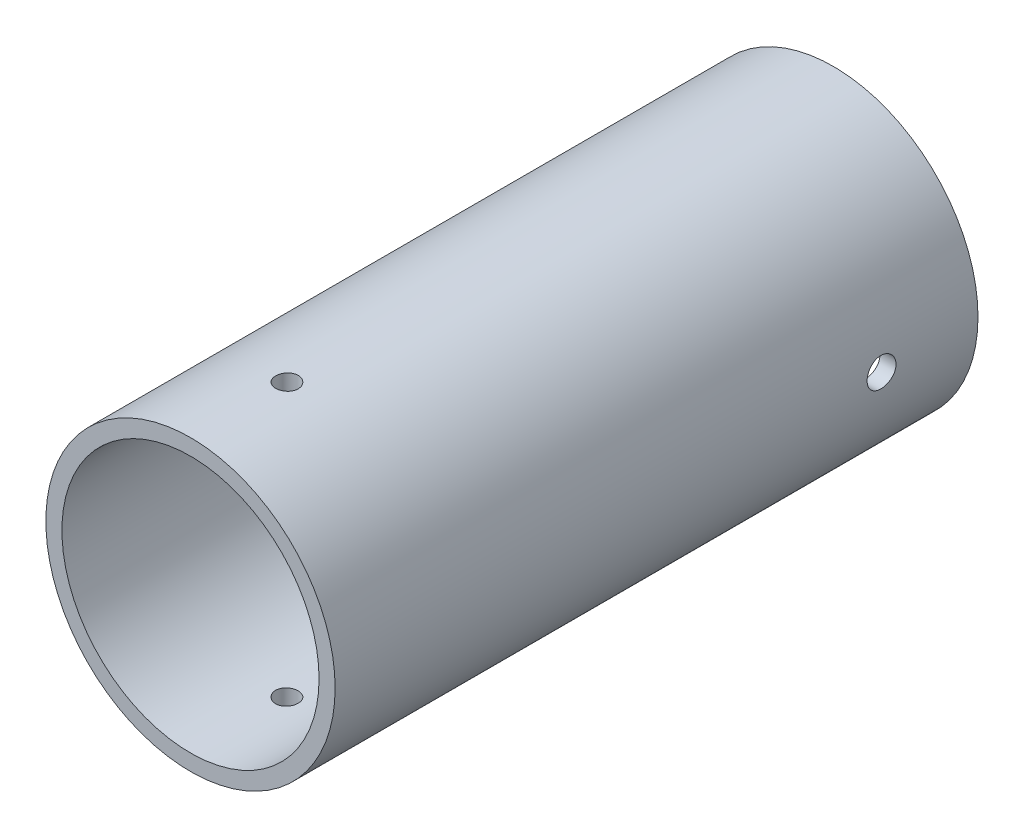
ISO-10303-21;
HEADER;
FILE_DESCRIPTION(('STEP AP214'),'2;1');
FILE_NAME('part.step','',(''),(''),'','','');
FILE_SCHEMA(('AUTOMOTIVE_DESIGN { 1 0 10303 214 1 1 1 1 }'));
ENDSEC;
DATA;
#1=APPLICATION_CONTEXT('core data for automotive mechanical design processes');
#2=APPLICATION_PROTOCOL_DEFINITION('international standard','automotive_design',2000,#1);
#3=PRODUCT_CONTEXT('',#1,'mechanical');
#4=PRODUCT('Part','Part','',(#3));
#5=PRODUCT_RELATED_PRODUCT_CATEGORY('part','',(#4));
#6=PRODUCT_DEFINITION_FORMATION('','',#4);
#7=PRODUCT_DEFINITION_CONTEXT('part definition',#1,'design');
#8=PRODUCT_DEFINITION('design','',#6,#7);
#9=PRODUCT_DEFINITION_SHAPE('','',#8);
#10=(LENGTH_UNIT() NAMED_UNIT(*) SI_UNIT(.MILLI.,.METRE.));
#11=(NAMED_UNIT(*) PLANE_ANGLE_UNIT() SI_UNIT($,.RADIAN.));
#12=(NAMED_UNIT(*) SI_UNIT($,.STERADIAN.) SOLID_ANGLE_UNIT());
#13=UNCERTAINTY_MEASURE_WITH_UNIT(LENGTH_MEASURE(1.E-05),#10,'distance_accuracy_value','');
#14=(GEOMETRIC_REPRESENTATION_CONTEXT(3) GLOBAL_UNCERTAINTY_ASSIGNED_CONTEXT((#13)) GLOBAL_UNIT_ASSIGNED_CONTEXT((#10,
#11,#12)) REPRESENTATION_CONTEXT('',''));
#15=CARTESIAN_POINT('',(0.,0.,0.));
#16=DIRECTION('',(0.,0.,1.));
#17=DIRECTION('',(1.,0.,0.));
#18=AXIS2_PLACEMENT_3D('',#15,#16,#17);
#19=CARTESIAN_POINT('',(0.,0.,-100.));
#20=DIRECTION('',(0.,0.,1.));
#21=DIRECTION('',(1.,0.,0.));
#22=AXIS2_PLACEMENT_3D('',#19,#20,#21);
#23=CYLINDRICAL_SURFACE('',#22,22.5);
#24=CARTESIAN_POINT('',(-22.5,0.,-52.5919987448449));
#25=CARTESIAN_POINT('',(-22.4999999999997,-5.61704679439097E-05,-52.5919987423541));
#26=CARTESIAN_POINT('',(-22.4999999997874,-0.000112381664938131,-52.5919939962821));
#27=CARTESIAN_POINT('',(-22.4999999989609,-0.000223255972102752,-52.5919751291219));
#28=CARTESIAN_POINT('',(-22.4999999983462,-0.000277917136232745,-52.5919609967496));
#29=CARTESIAN_POINT('',(-22.4999999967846,-0.000384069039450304,-52.5919237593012));
#30=CARTESIAN_POINT('',(-22.4999999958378,-0.000435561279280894,-52.591900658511));
#31=CARTESIAN_POINT('',(-22.4999999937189,-0.000533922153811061,-52.5918461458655));
#32=CARTESIAN_POINT('',(-22.4999999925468,-0.000580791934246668,-52.5918147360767));
#33=CARTESIAN_POINT('',(-22.499999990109,-0.00066859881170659,-52.5917444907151));
#34=CARTESIAN_POINT('',(-22.4999999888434,-0.00070953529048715,-52.5917056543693));
#35=CARTESIAN_POINT('',(-22.4999999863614,-0.000784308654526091,-52.5916216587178));
#36=CARTESIAN_POINT('',(-22.499999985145,-0.000818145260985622,-52.5915764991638));
#37=CARTESIAN_POINT('',(-22.4999999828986,-0.00087775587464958,-52.5914811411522));
#38=CARTESIAN_POINT('',(-22.4999999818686,-0.000903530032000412,-52.5914309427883));
#39=CARTESIAN_POINT('',(-22.4999999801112,-0.000946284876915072,-52.5913269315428));
#40=CARTESIAN_POINT('',(-22.4999999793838,-0.000963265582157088,-52.5912731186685));
#41=CARTESIAN_POINT('',(-22.4999999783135,-0.00098795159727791,-52.591163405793));
#42=CARTESIAN_POINT('',(-22.4999999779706,-0.000995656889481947,-52.5911075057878));
#43=CARTESIAN_POINT('',(-22.499999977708,-0.00100157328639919,-52.5909952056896));
#44=CARTESIAN_POINT('',(-22.4999999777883,-0.000999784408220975,-52.5909388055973));
#45=CARTESIAN_POINT('',(-22.4999999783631,-0.00098676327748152,-52.5908271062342));
#46=CARTESIAN_POINT('',(-22.4999999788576,-0.000975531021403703,-52.5907718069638));
#47=CARTESIAN_POINT('',(-22.4999999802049,-0.000943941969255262,-52.5906638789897));
#48=CARTESIAN_POINT('',(-22.4999999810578,-0.000923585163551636,-52.5906112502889));
#49=CARTESIAN_POINT('',(-22.4999999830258,-0.000874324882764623,-52.5905101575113));
#50=CARTESIAN_POINT('',(-22.4999999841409,-0.000845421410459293,-52.5904616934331));
#51=CARTESIAN_POINT('',(-22.4999999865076,-0.00077988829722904,-52.5903703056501));
#52=CARTESIAN_POINT('',(-22.4999999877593,-0.000743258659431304,-52.5903273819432));
#53=CARTESIAN_POINT('',(-22.499999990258,-0.000663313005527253,-52.5902482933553));
#54=CARTESIAN_POINT('',(-22.4999999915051,-0.000619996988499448,-52.5902121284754));
#55=CARTESIAN_POINT('',(-22.499999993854,-0.000527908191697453,-52.5901475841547));
#56=CARTESIAN_POINT('',(-22.4999999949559,-0.000479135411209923,-52.590119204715));
#57=CARTESIAN_POINT('',(-22.4999999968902,-0.000377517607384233,-52.5900710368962));
#58=CARTESIAN_POINT('',(-22.4999999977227,-0.000324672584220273,-52.5900512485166));
#59=CARTESIAN_POINT('',(-22.4999999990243,-0.000216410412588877,-52.5900208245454));
#60=CARTESIAN_POINT('',(-22.4999999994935,-0.000160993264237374,-52.5900101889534));
#61=CARTESIAN_POINT('',(-22.5000000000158,-4.91599688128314E-05,-52.5899983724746));
#62=CARTESIAN_POINT('',(-22.5000000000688,7.2561782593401E-06,-52.5899971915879));
#63=CARTESIAN_POINT('',(-22.4999999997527,0.000119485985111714,-52.5900043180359));
#64=CARTESIAN_POINT('',(-22.4999999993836,0.000175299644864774,-52.5900126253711));
#65=CARTESIAN_POINT('',(-22.4999999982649,0.000284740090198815,-52.5900384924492));
#66=CARTESIAN_POINT('',(-22.4999999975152,0.000338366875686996,-52.5900560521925));
#67=CARTESIAN_POINT('',(-22.4999999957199,0.000441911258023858,-52.5900999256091));
#68=CARTESIAN_POINT('',(-22.4999999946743,0.000491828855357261,-52.5901262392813));
#69=CARTESIAN_POINT('',(-22.4999999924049,0.000586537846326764,-52.5901868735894));
#70=CARTESIAN_POINT('',(-22.4999999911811,0.000631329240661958,-52.5902211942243));
#71=CARTESIAN_POINT('',(-22.4999999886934,0.000714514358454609,-52.5902968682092));
#72=CARTESIAN_POINT('',(-22.4999999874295,0.000752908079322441,-52.590338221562));
#73=CARTESIAN_POINT('',(-22.499999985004,0.00082220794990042,-52.5904267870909));
#74=CARTESIAN_POINT('',(-22.4999999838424,0.000853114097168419,-52.5904739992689));
#75=CARTESIAN_POINT('',(-22.4999999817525,0.000906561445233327,-52.5905729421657));
#76=CARTESIAN_POINT('',(-22.4999999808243,0.000929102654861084,-52.5906246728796));
#77=CARTESIAN_POINT('',(-22.4999999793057,0.000965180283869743,-52.590731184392));
#78=CARTESIAN_POINT('',(-22.4999999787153,0.000978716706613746,-52.5907859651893));
#79=CARTESIAN_POINT('',(-22.4999999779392,0.000996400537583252,-52.5908970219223));
#80=CARTESIAN_POINT('',(-22.4999999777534,0.00100054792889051,-52.5909532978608));
#81=CARTESIAN_POINT('',(-22.4999999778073,0.000999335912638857,-52.5910657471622));
#82=CARTESIAN_POINT('',(-22.499999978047,0.000993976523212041,-52.5911219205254));
#83=CARTESIAN_POINT('',(-22.4999999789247,0.000973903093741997,-52.5912325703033));
#84=CARTESIAN_POINT('',(-22.4999999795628,0.000959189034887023,-52.5912870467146));
#85=CARTESIAN_POINT('',(-22.4999999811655,0.0009208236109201,-52.5913927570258));
#86=CARTESIAN_POINT('',(-22.4999999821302,0.000897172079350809,-52.5914439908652));
#87=CARTESIAN_POINT('',(-22.4999999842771,0.000841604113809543,-52.591541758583));
#88=CARTESIAN_POINT('',(-22.4999999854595,0.000809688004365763,-52.5915882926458));
#89=CARTESIAN_POINT('',(-22.4999999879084,0.000738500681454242,-52.5916753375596));
#90=CARTESIAN_POINT('',(-22.4999999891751,0.000699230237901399,-52.5917158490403));
#91=CARTESIAN_POINT('',(-22.4999999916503,0.000614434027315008,-52.5917897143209));
#92=CARTESIAN_POINT('',(-22.4999999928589,0.000568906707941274,-52.5918230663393));
#93=CARTESIAN_POINT('',(-22.499999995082,0.000472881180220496,-52.5918816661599));
#94=CARTESIAN_POINT('',(-22.4999999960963,0.000422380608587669,-52.5919069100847));
#95=CARTESIAN_POINT('',(-22.4999999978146,0.00031789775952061,-52.5919485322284));
#96=CARTESIAN_POINT('',(-22.4999999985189,0.000263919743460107,-52.5919649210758));
#97=CARTESIAN_POINT('',(-22.4999999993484,0.000174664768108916,-52.5919839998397));
#98=CARTESIAN_POINT('',(-22.4999999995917,0.000139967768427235,-52.5919895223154));
#99=CARTESIAN_POINT('',(-22.4999999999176,7.01858140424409E-05,-52.5919968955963));
#100=CARTESIAN_POINT('',(-22.5000000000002,3.5100859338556E-05,-52.5919987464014));
#101=CARTESIAN_POINT('',(-22.5,0.,-52.5919987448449));
#102=B_SPLINE_CURVE_WITH_KNOTS('',3,(#24,#25,#26,#27,#28,#29,#30,#31,#32,#33,#34,#35,#36,#37,
#38,#39,#40,#41,#42,#43,#44,#45,#46,#47,#48,#49,#50,#51,#52,#53,#54,#55,#56,#57,#58,#59,#60,#61,
#62,#63,#64,#65,#66,#67,#68,#69,#70,#71,#72,#73,#74,#75,#76,#77,#78,#79,#80,#81,#82,#83,#84,#85,
#86,#87,#88,#89,#90,#91,#92,#93,#94,#95,#96,#97,#98,#99,#100,#101),.UNSPECIFIED.,.T.,.F.,(4,2,2,
2,2,2,2,2,2,2,2,2,2,2,2,2,2,2,2,2,2,2,2,2,2,2,2,2,2,2,2,2,2,2,2,2,2,2,4),(0.,
0.00016838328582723,0.000336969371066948,0.000505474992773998,0.000673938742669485,
0.000842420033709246,0.00101090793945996,0.00117939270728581,0.00134787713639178,
0.00151636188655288,0.00168484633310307,0.00185333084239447,0.00202181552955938,
0.00219030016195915,0.00235878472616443,0.0025272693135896,0.00269575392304,0.00286423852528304,
0.00303272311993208,0.00320120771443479,0.00336969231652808,0.00353817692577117,
0.00370666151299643,0.00387514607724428,0.00404363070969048,0.00421211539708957,
0.00438059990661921,0.00454908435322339,0.00471756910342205,0.00488605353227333,
0.00505453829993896,0.00522302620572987,0.00539150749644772,0.00555997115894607,
0.0057284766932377,0.00589706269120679,0.00606544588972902,0.00617066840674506,
0.00627589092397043),.UNSPECIFIED.);
#103=CARTESIAN_POINT('',(-22.5,0.,-52.5919987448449));
#104=VERTEX_POINT('',#103);
#105=EDGE_CURVE('E176',#104,#104,#102,.T.);
#106=ORIENTED_EDGE('',*,*,#105,.F.);
#107=EDGE_LOOP('',(#106));
#108=FACE_BOUND('',#107,.T.);
#109=CARTESIAN_POINT('',(0.,-22.5,-13.25));
#110=CARTESIAN_POINT('',(-0.0981391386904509,-22.4999991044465,-13.2500042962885));
#111=CARTESIAN_POINT('',(-0.196345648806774,-22.4993510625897,-13.2582831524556));
#112=CARTESIAN_POINT('',(-0.390043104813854,-22.4968282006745,-13.2911881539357));
#113=CARTESIAN_POINT('',(-0.485530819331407,-22.4949519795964,-13.3158329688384));
#114=CARTESIAN_POINT('',(-0.670957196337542,-22.4901848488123,-13.3807543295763));
#115=CARTESIAN_POINT('',(-0.760898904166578,-22.487294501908,-13.4210222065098));
#116=CARTESIAN_POINT('',(-0.932724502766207,-22.4808235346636,-13.5160315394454));
#117=CARTESIAN_POINT('',(-1.01461014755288,-22.477243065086,-13.5707698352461));
#118=CARTESIAN_POINT('',(-1.16820468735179,-22.4697848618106,-13.6932989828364));
#119=CARTESIAN_POINT('',(-1.23989307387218,-22.4659065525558,-13.76111550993));
#120=CARTESIAN_POINT('',(-1.37088229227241,-22.4582946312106,-13.9078220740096));
#121=CARTESIAN_POINT('',(-1.43018258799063,-22.4545610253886,-13.9867125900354));
#122=CARTESIAN_POINT('',(-1.53478037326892,-22.4476548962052,-14.1534501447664));
#123=CARTESIAN_POINT('',(-1.58006005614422,-22.4444830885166,-14.241308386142));
#124=CARTESIAN_POINT('',(-1.65521751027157,-22.4390660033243,-14.4234092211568));
#125=CARTESIAN_POINT('',(-1.68509552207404,-22.4368207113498,-14.5176517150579));
#126=CARTESIAN_POINT('',(-1.72854257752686,-22.4335155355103,-14.7096420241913));
#127=CARTESIAN_POINT('',(-1.74214476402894,-22.4324532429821,-14.8073822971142));
#128=CARTESIAN_POINT('',(-1.75275641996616,-22.4316266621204,-15.0037640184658));
#129=CARTESIAN_POINT('',(-1.74976616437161,-22.4318623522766,-15.1024054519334));
#130=CARTESIAN_POINT('',(-1.72730523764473,-22.4336029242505,-15.2975626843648));
#131=CARTESIAN_POINT('',(-1.70787053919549,-22.4351050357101,-15.394082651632));
#132=CARTESIAN_POINT('',(-1.65312826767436,-22.4392048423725,-15.5824863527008));
#133=CARTESIAN_POINT('',(-1.61782055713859,-22.4418025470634,-15.6743700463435));
#134=CARTESIAN_POINT('',(-1.5322940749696,-22.4478040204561,-15.8510078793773));
#135=CARTESIAN_POINT('',(-1.48205911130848,-22.4512086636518,-15.9357541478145));
#136=CARTESIAN_POINT('',(-1.36811579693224,-22.4584395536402,-16.0956254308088));
#137=CARTESIAN_POINT('',(-1.30440720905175,-22.4622658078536,-16.1707502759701));
#138=CARTESIAN_POINT('',(-1.16512309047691,-22.4699210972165,-16.3094553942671));
#139=CARTESIAN_POINT('',(-1.08951645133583,-22.4737501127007,-16.3730044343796));
#140=CARTESIAN_POINT('',(-0.928691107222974,-22.4809697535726,-16.4865127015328));
#141=CARTESIAN_POINT('',(-0.843472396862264,-22.4843603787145,-16.5364719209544));
#142=CARTESIAN_POINT('',(-0.665822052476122,-22.4903217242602,-16.6213802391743));
#143=CARTESIAN_POINT('',(-0.573389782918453,-22.4928923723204,-16.6563280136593));
#144=CARTESIAN_POINT('',(-0.38394519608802,-22.4969232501,-16.7101998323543));
#145=CARTESIAN_POINT('',(-0.286932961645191,-22.4983834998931,-16.7291241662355));
#146=CARTESIAN_POINT('',(-0.0913530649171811,-22.5000264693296,-16.7503728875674));
#147=CARTESIAN_POINT('',(0.00720988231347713,-22.5002125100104,-16.7527404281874));
#148=CARTESIAN_POINT('',(0.203331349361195,-22.499294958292,-16.7409213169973));
#149=CARTESIAN_POINT('',(0.300889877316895,-22.4981913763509,-16.7267347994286));
#150=CARTESIAN_POINT('',(0.492110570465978,-22.4948208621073,-16.6822460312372));
#151=CARTESIAN_POINT('',(0.585777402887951,-22.4925553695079,-16.6519637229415));
#152=CARTESIAN_POINT('',(0.76670026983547,-22.4871156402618,-16.5761633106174));
#153=CARTESIAN_POINT('',(0.853956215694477,-22.4839413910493,-16.530644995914));
#154=CARTESIAN_POINT('',(1.01977718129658,-22.4770319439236,-16.4255558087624));
#155=CARTESIAN_POINT('',(1.09832399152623,-22.4732956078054,-16.3659562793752));
#156=CARTESIAN_POINT('',(1.24431336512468,-22.4656858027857,-16.234437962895));
#157=CARTESIAN_POINT('',(1.31175576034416,-22.4618123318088,-16.1625189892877));
#158=CARTESIAN_POINT('',(1.43376934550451,-22.4543550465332,-16.0082163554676));
#159=CARTESIAN_POINT('',(1.48831242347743,-22.4507718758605,-15.9258104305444));
#160=CARTESIAN_POINT('',(1.58278648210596,-22.444309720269,-15.7529842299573));
#161=CARTESIAN_POINT('',(1.62271759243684,-22.4414307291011,-15.6625640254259));
#162=CARTESIAN_POINT('',(1.68678609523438,-22.4367063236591,-15.4763764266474));
#163=CARTESIAN_POINT('',(1.71094083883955,-22.4348597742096,-15.3806150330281));
#164=CARTESIAN_POINT('',(1.74282748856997,-22.4324054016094,-15.1863808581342));
#165=CARTESIAN_POINT('',(1.75055966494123,-22.4317975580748,-15.0879081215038));
#166=CARTESIAN_POINT('',(1.74937874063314,-22.431889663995,-14.8913259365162));
#167=CARTESIAN_POINT('',(1.74050981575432,-22.4325861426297,-14.7932162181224));
#168=CARTESIAN_POINT('',(1.70647040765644,-22.4352010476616,-14.5998840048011));
#169=CARTESIAN_POINT('',(1.68129989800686,-22.43711947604,-14.5046615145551));
#170=CARTESIAN_POINT('',(1.61538268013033,-22.4419612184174,-14.3198028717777));
#171=CARTESIAN_POINT('',(1.57463660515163,-22.4448844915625,-14.2301664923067));
#172=CARTESIAN_POINT('',(1.47873005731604,-22.4514065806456,-14.0589997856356));
#173=CARTESIAN_POINT('',(1.42356985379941,-22.4550053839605,-13.9774693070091));
#174=CARTESIAN_POINT('',(1.30023520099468,-22.4624843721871,-13.8246030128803));
#175=CARTESIAN_POINT('',(1.23202818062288,-22.4663652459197,-13.7532935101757));
#176=CARTESIAN_POINT('',(1.08459226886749,-22.4739648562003,-13.6231078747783));
#177=CARTESIAN_POINT('',(1.00536070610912,-22.4776835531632,-13.5642347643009));
#178=CARTESIAN_POINT('',(0.837990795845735,-22.4845456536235,-13.4605248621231));
#179=CARTESIAN_POINT('',(0.749837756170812,-22.4876880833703,-13.4157117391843));
#180=CARTESIAN_POINT('',(0.567295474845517,-22.4930317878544,-13.3415795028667));
#181=CARTESIAN_POINT('',(0.47291358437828,-22.4952341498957,-13.3122424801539));
#182=CARTESIAN_POINT('',(0.31497390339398,-22.4978807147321,-13.2774121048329));
#183=CARTESIAN_POINT('',(0.252433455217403,-22.4986718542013,-13.2671461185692));
#184=CARTESIAN_POINT('',(0.126604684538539,-22.4997317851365,-13.2534386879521));
#185=CARTESIAN_POINT('',(0.0633163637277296,-22.5000005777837,-13.2499972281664));
#186=CARTESIAN_POINT('',(0.,-22.5,-13.25));
#187=B_SPLINE_CURVE_WITH_KNOTS('',3,(#109,#110,#111,#112,#113,#114,#115,#116,#117,#118,#119,
#120,#121,#122,#123,#124,#125,#126,#127,#128,#129,#130,#131,#132,#133,#134,#135,#136,#137,#138,
#139,#140,#141,#142,#143,#144,#145,#146,#147,#148,#149,#150,#151,#152,#153,#154,#155,#156,#157,
#158,#159,#160,#161,#162,#163,#164,#165,#166,#167,#168,#169,#170,#171,#172,#173,#174,#175,#176,
#177,#178,#179,#180,#181,#182,#183,#184,#185,#186),.UNSPECIFIED.,.T.,.F.,(4,2,2,2,2,2,2,2,2,2,2,
2,2,2,2,2,2,2,2,2,2,2,2,2,2,2,2,2,2,2,2,2,2,2,2,2,2,2,4),(0.,0.294186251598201,
0.588708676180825,0.883067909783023,1.17736291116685,1.47224166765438,1.76713318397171,
2.06239770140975,2.35765760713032,2.65231523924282,2.94696798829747,3.24097783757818,
3.53499023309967,3.82932272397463,4.12366039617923,4.41878083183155,4.71390143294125,
5.00904806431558,5.30418935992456,5.59856111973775,5.89293049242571,6.18693599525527,
6.48094556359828,6.77555871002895,7.07017631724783,7.3654301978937,7.66068145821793,
7.95560744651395,8.25052858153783,8.54466604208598,8.83880397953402,9.13292995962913,
9.42705044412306,9.72191500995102,10.0168511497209,10.3122811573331,10.6073685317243,
10.7971689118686,10.9869688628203),.UNSPECIFIED.);
#188=CARTESIAN_POINT('',(0.,-22.5,-13.25));
#189=VERTEX_POINT('',#188);
#190=EDGE_CURVE('E56',#189,#189,#187,.T.);
#191=ORIENTED_EDGE('',*,*,#190,.F.);
#192=EDGE_LOOP('',(#191));
#193=FACE_BOUND('',#192,.T.);
#194=CARTESIAN_POINT('',(0.,22.5,-13.25));
#195=CARTESIAN_POINT('',(0.0981391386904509,22.4999991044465,-13.2500042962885));
#196=CARTESIAN_POINT('',(0.196345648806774,22.4993510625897,-13.2582831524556));
#197=CARTESIAN_POINT('',(0.390043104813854,22.4968282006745,-13.2911881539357));
#198=CARTESIAN_POINT('',(0.485530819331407,22.4949519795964,-13.3158329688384));
#199=CARTESIAN_POINT('',(0.670957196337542,22.4901848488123,-13.3807543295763));
#200=CARTESIAN_POINT('',(0.760898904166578,22.487294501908,-13.4210222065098));
#201=CARTESIAN_POINT('',(0.932724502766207,22.4808235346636,-13.5160315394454));
#202=CARTESIAN_POINT('',(1.01461014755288,22.477243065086,-13.5707698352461));
#203=CARTESIAN_POINT('',(1.16820468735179,22.4697848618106,-13.6932989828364));
#204=CARTESIAN_POINT('',(1.23989307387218,22.4659065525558,-13.76111550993));
#205=CARTESIAN_POINT('',(1.37088229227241,22.4582946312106,-13.9078220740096));
#206=CARTESIAN_POINT('',(1.43018258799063,22.4545610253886,-13.9867125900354));
#207=CARTESIAN_POINT('',(1.53478037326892,22.4476548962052,-14.1534501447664));
#208=CARTESIAN_POINT('',(1.58006005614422,22.4444830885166,-14.241308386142));
#209=CARTESIAN_POINT('',(1.65521751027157,22.4390660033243,-14.4234092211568));
#210=CARTESIAN_POINT('',(1.68509552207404,22.4368207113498,-14.5176517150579));
#211=CARTESIAN_POINT('',(1.72854257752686,22.4335155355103,-14.7096420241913));
#212=CARTESIAN_POINT('',(1.74214476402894,22.4324532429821,-14.8073822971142));
#213=CARTESIAN_POINT('',(1.75275641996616,22.4316266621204,-15.0037640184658));
#214=CARTESIAN_POINT('',(1.74976616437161,22.4318623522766,-15.1024054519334));
#215=CARTESIAN_POINT('',(1.72730523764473,22.4336029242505,-15.2975626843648));
#216=CARTESIAN_POINT('',(1.70787053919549,22.4351050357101,-15.394082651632));
#217=CARTESIAN_POINT('',(1.65312826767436,22.4392048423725,-15.5824863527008));
#218=CARTESIAN_POINT('',(1.61782055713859,22.4418025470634,-15.6743700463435));
#219=CARTESIAN_POINT('',(1.5322940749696,22.4478040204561,-15.8510078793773));
#220=CARTESIAN_POINT('',(1.48205911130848,22.4512086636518,-15.9357541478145));
#221=CARTESIAN_POINT('',(1.36811579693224,22.4584395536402,-16.0956254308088));
#222=CARTESIAN_POINT('',(1.30440720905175,22.4622658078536,-16.1707502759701));
#223=CARTESIAN_POINT('',(1.16512309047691,22.4699210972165,-16.3094553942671));
#224=CARTESIAN_POINT('',(1.08951645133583,22.4737501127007,-16.3730044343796));
#225=CARTESIAN_POINT('',(0.928691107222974,22.4809697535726,-16.4865127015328));
#226=CARTESIAN_POINT('',(0.843472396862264,22.4843603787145,-16.5364719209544));
#227=CARTESIAN_POINT('',(0.665822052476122,22.4903217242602,-16.6213802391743));
#228=CARTESIAN_POINT('',(0.573389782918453,22.4928923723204,-16.6563280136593));
#229=CARTESIAN_POINT('',(0.38394519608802,22.4969232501,-16.7101998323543));
#230=CARTESIAN_POINT('',(0.286932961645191,22.4983834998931,-16.7291241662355));
#231=CARTESIAN_POINT('',(0.0913530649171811,22.5000264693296,-16.7503728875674));
#232=CARTESIAN_POINT('',(-0.00720988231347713,22.5002125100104,-16.7527404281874));
#233=CARTESIAN_POINT('',(-0.203331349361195,22.499294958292,-16.7409213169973));
#234=CARTESIAN_POINT('',(-0.300889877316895,22.4981913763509,-16.7267347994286));
#235=CARTESIAN_POINT('',(-0.492110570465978,22.4948208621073,-16.6822460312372));
#236=CARTESIAN_POINT('',(-0.585777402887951,22.4925553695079,-16.6519637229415));
#237=CARTESIAN_POINT('',(-0.76670026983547,22.4871156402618,-16.5761633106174));
#238=CARTESIAN_POINT('',(-0.853956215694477,22.4839413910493,-16.530644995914));
#239=CARTESIAN_POINT('',(-1.01977718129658,22.4770319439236,-16.4255558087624));
#240=CARTESIAN_POINT('',(-1.09832399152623,22.4732956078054,-16.3659562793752));
#241=CARTESIAN_POINT('',(-1.24431336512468,22.4656858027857,-16.234437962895));
#242=CARTESIAN_POINT('',(-1.31175576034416,22.4618123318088,-16.1625189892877));
#243=CARTESIAN_POINT('',(-1.43376934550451,22.4543550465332,-16.0082163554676));
#244=CARTESIAN_POINT('',(-1.48831242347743,22.4507718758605,-15.9258104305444));
#245=CARTESIAN_POINT('',(-1.58278648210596,22.444309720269,-15.7529842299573));
#246=CARTESIAN_POINT('',(-1.62271759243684,22.4414307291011,-15.6625640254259));
#247=CARTESIAN_POINT('',(-1.68678609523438,22.4367063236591,-15.4763764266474));
#248=CARTESIAN_POINT('',(-1.71094083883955,22.4348597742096,-15.3806150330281));
#249=CARTESIAN_POINT('',(-1.74282748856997,22.4324054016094,-15.1863808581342));
#250=CARTESIAN_POINT('',(-1.75055966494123,22.4317975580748,-15.0879081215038));
#251=CARTESIAN_POINT('',(-1.74937874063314,22.431889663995,-14.8913259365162));
#252=CARTESIAN_POINT('',(-1.74050981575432,22.4325861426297,-14.7932162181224));
#253=CARTESIAN_POINT('',(-1.70647040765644,22.4352010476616,-14.5998840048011));
#254=CARTESIAN_POINT('',(-1.68129989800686,22.43711947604,-14.5046615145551));
#255=CARTESIAN_POINT('',(-1.61538268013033,22.4419612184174,-14.3198028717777));
#256=CARTESIAN_POINT('',(-1.57463660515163,22.4448844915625,-14.2301664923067));
#257=CARTESIAN_POINT('',(-1.47873005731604,22.4514065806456,-14.0589997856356));
#258=CARTESIAN_POINT('',(-1.42356985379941,22.4550053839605,-13.9774693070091));
#259=CARTESIAN_POINT('',(-1.30023520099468,22.4624843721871,-13.8246030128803));
#260=CARTESIAN_POINT('',(-1.23202818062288,22.4663652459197,-13.7532935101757));
#261=CARTESIAN_POINT('',(-1.08459226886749,22.4739648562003,-13.6231078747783));
#262=CARTESIAN_POINT('',(-1.00536070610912,22.4776835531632,-13.5642347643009));
#263=CARTESIAN_POINT('',(-0.837990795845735,22.4845456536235,-13.4605248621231));
#264=CARTESIAN_POINT('',(-0.749837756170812,22.4876880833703,-13.4157117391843));
#265=CARTESIAN_POINT('',(-0.567295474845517,22.4930317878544,-13.3415795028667));
#266=CARTESIAN_POINT('',(-0.47291358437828,22.4952341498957,-13.3122424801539));
#267=CARTESIAN_POINT('',(-0.31497390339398,22.4978807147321,-13.2774121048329));
#268=CARTESIAN_POINT('',(-0.252433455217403,22.4986718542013,-13.2671461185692));
#269=CARTESIAN_POINT('',(-0.126604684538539,22.4997317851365,-13.2534386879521));
#270=CARTESIAN_POINT('',(-0.0633163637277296,22.5000005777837,-13.2499972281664));
#271=CARTESIAN_POINT('',(0.,22.5,-13.25));
#272=B_SPLINE_CURVE_WITH_KNOTS('',3,(#194,#195,#196,#197,#198,#199,#200,#201,#202,#203,#204,
#205,#206,#207,#208,#209,#210,#211,#212,#213,#214,#215,#216,#217,#218,#219,#220,#221,#222,#223,
#224,#225,#226,#227,#228,#229,#230,#231,#232,#233,#234,#235,#236,#237,#238,#239,#240,#241,#242,
#243,#244,#245,#246,#247,#248,#249,#250,#251,#252,#253,#254,#255,#256,#257,#258,#259,#260,#261,
#262,#263,#264,#265,#266,#267,#268,#269,#270,#271),.UNSPECIFIED.,.T.,.F.,(4,2,2,2,2,2,2,2,2,2,2,
2,2,2,2,2,2,2,2,2,2,2,2,2,2,2,2,2,2,2,2,2,2,2,2,2,2,2,4),(0.,0.294186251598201,
0.588708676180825,0.883067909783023,1.17736291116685,1.47224166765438,1.76713318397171,
2.06239770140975,2.35765760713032,2.65231523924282,2.94696798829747,3.24097783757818,
3.53499023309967,3.82932272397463,4.12366039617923,4.41878083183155,4.71390143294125,
5.00904806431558,5.30418935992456,5.59856111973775,5.89293049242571,6.18693599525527,
6.48094556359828,6.77555871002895,7.07017631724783,7.3654301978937,7.66068145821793,
7.95560744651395,8.25052858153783,8.54466604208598,8.83880397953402,9.13292995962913,
9.42705044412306,9.72191500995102,10.0168511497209,10.3122811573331,10.6073685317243,
10.7971689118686,10.9869688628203),.UNSPECIFIED.);
#273=CARTESIAN_POINT('',(0.,22.5,-13.25));
#274=VERTEX_POINT('',#273);
#275=EDGE_CURVE('E179',#274,#274,#272,.T.);
#276=ORIENTED_EDGE('',*,*,#275,.F.);
#277=EDGE_LOOP('',(#276));
#278=FACE_BOUND('',#277,.T.);
#279=CARTESIAN_POINT('',(0.,0.,0.));
#280=DIRECTION('',(0.,0.,1.));
#281=DIRECTION('',(1.,0.,0.));
#282=AXIS2_PLACEMENT_3D('',#279,#280,#281);
#283=CIRCLE('',#282,22.5);
#284=CARTESIAN_POINT('',(22.5,0.,0.));
#285=VERTEX_POINT('',#284);
#286=EDGE_CURVE('E40',#285,#285,#283,.T.);
#287=ORIENTED_EDGE('',*,*,#286,.F.);
#288=EDGE_LOOP('',(#287));
#289=FACE_BOUND('',#288,.T.);
#290=CARTESIAN_POINT('',(0.,0.,-100.));
#291=DIRECTION('',(0.,0.,1.));
#292=DIRECTION('',(1.,0.,0.));
#293=AXIS2_PLACEMENT_3D('',#290,#291,#292);
#294=CIRCLE('',#293,22.5);
#295=CARTESIAN_POINT('',(22.5,0.,-100.));
#296=VERTEX_POINT('',#295);
#297=EDGE_CURVE('E10',#296,#296,#294,.T.);
#298=ORIENTED_EDGE('',*,*,#297,.T.);
#299=EDGE_LOOP('',(#298));
#300=FACE_BOUND('',#299,.T.);
#301=CARTESIAN_POINT('',(22.5,0.,-87.25));
#302=CARTESIAN_POINT('',(22.4999985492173,-0.126045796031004,-87.2499945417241));
#303=CARTESIAN_POINT('',(22.4989295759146,-0.252174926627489,-87.239372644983));
#304=CARTESIAN_POINT('',(22.4947680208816,-0.500936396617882,-87.1971601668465));
#305=CARTESIAN_POINT('',(22.4916732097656,-0.623564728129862,-87.1655464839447));
#306=CARTESIAN_POINT('',(22.4838093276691,-0.861686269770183,-87.0822799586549));
#307=CARTESIAN_POINT('',(22.4790412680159,-0.977183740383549,-87.0306392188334));
#308=CARTESIAN_POINT('',(22.4683640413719,-1.19784636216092,-86.9088079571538));
#309=CARTESIAN_POINT('',(22.462455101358,-1.30301356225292,-86.8386211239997));
#310=CARTESIAN_POINT('',(22.4501342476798,-1.50043398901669,-86.6814189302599));
#311=CARTESIAN_POINT('',(22.443720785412,-1.59264482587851,-86.5943504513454));
#312=CARTESIAN_POINT('',(22.4311265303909,-1.76117067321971,-86.4059697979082));
#313=CARTESIAN_POINT('',(22.4249457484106,-1.83748494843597,-86.3046569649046));
#314=CARTESIAN_POINT('',(22.4135008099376,-1.97220143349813,-86.0903983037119));
#315=CARTESIAN_POINT('',(22.4082386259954,-2.03056529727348,-85.9774282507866));
#316=CARTESIAN_POINT('',(22.3992458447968,-2.12747936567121,-85.7432299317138));
#317=CARTESIAN_POINT('',(22.3955152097,-2.1660300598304,-85.6220018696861));
#318=CARTESIAN_POINT('',(22.390021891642,-2.22209784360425,-85.3751609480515));
#319=CARTESIAN_POINT('',(22.3882526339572,-2.23968521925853,-85.2495642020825));
#320=CARTESIAN_POINT('',(22.3868619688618,-2.25354439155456,-84.9971900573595));
#321=CARTESIAN_POINT('',(22.3872405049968,-2.2498167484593,-84.8704126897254));
#322=CARTESIAN_POINT('',(22.390096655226,-2.22120963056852,-84.61976055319));
#323=CARTESIAN_POINT('',(22.3925666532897,-2.19640689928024,-84.4958769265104));
#324=CARTESIAN_POINT('',(22.3993155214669,-2.12647307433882,-84.2540395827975));
#325=CARTESIAN_POINT('',(22.4035944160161,-2.08134170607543,-84.1360859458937));
#326=CARTESIAN_POINT('',(22.4134877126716,-1.97194701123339,-83.9092144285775));
#327=CARTESIAN_POINT('',(22.4191044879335,-1.90764963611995,-83.8003130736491));
#328=CARTESIAN_POINT('',(22.4310386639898,-1.76177256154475,-83.5948182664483));
#329=CARTESIAN_POINT('',(22.4373560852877,-1.68019235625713,-83.498225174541));
#330=CARTESIAN_POINT('',(22.4500136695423,-1.50163675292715,-83.3196428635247));
#331=CARTESIAN_POINT('',(22.4563538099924,-1.40459507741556,-83.2377198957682));
#332=CARTESIAN_POINT('',(22.4683161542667,-1.19810133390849,-83.0913168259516));
#333=CARTESIAN_POINT('',(22.4739383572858,-1.0886492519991,-83.0268367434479));
#334=CARTESIAN_POINT('',(22.4838332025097,-0.860395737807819,-82.9171524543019));
#335=CARTESIAN_POINT('',(22.4881056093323,-0.741592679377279,-82.8719516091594));
#336=CARTESIAN_POINT('',(22.4948170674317,-0.498031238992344,-82.8021574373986));
#337=CARTESIAN_POINT('',(22.4972561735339,-0.373273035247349,-82.7775634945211));
#338=CARTESIAN_POINT('',(22.500019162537,-0.121916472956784,-82.7497653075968));
#339=CARTESIAN_POINT('',(22.5003520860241,0.0046716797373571,-82.7464696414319));
#340=CARTESIAN_POINT('',(22.4988894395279,0.256598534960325,-82.7611214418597));
#341=CARTESIAN_POINT('',(22.4970938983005,0.381937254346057,-82.7790686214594));
#342=CARTESIAN_POINT('',(22.4915818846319,0.627543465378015,-82.8356208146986));
#343=CARTESIAN_POINT('',(22.4878693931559,0.747820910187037,-82.8741830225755));
#344=CARTESIAN_POINT('',(22.4789399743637,0.980199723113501,-82.9708266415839));
#345=CARTESIAN_POINT('',(22.4737230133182,1.09230090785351,-83.0289084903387));
#346=CARTESIAN_POINT('',(22.4623456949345,1.30555840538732,-83.1631693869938));
#347=CARTESIAN_POINT('',(22.4561822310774,1.40667673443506,-83.2394085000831));
#348=CARTESIAN_POINT('',(22.4436134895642,1.59471365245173,-83.4077336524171));
#349=CARTESIAN_POINT('',(22.4372082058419,1.68163188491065,-83.4998200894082));
#350=CARTESIAN_POINT('',(22.424850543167,1.83911874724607,-83.6976247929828));
#351=CARTESIAN_POINT('',(22.4188998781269,1.90962737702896,-83.8033909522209));
#352=CARTESIAN_POINT('',(22.40815123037,2.0318810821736,-84.02531656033));
#353=CARTESIAN_POINT('',(22.4033532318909,2.08362641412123,-84.1414758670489));
#354=CARTESIAN_POINT('',(22.3954638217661,2.16678421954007,-84.380684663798));
#355=CARTESIAN_POINT('',(22.3923694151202,2.19823239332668,-84.503721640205));
#356=CARTESIAN_POINT('',(22.3882282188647,2.24001901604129,-84.7533621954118));
#357=CARTESIAN_POINT('',(22.3871813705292,2.25035807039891,-84.8799656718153));
#358=CARTESIAN_POINT('',(22.3872550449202,2.24962456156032,-85.1325490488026));
#359=CARTESIAN_POINT('',(22.3883660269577,2.2386462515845,-85.2585292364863));
#360=CARTESIAN_POINT('',(22.3926098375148,2.19578726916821,-85.5068460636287));
#361=CARTESIAN_POINT('',(22.3957426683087,2.16390657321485,-85.6291826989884));
#362=CARTESIAN_POINT('',(22.4036745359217,2.08017379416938,-85.8667390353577));
#363=CARTESIAN_POINT('',(22.4084733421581,2.02832447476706,-85.9819597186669));
#364=CARTESIAN_POINT('',(22.4191969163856,1.90613599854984,-86.2020780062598));
#365=CARTESIAN_POINT('',(22.4251216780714,1.83579694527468,-86.3069756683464));
#366=CARTESIAN_POINT('',(22.4374609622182,1.67827175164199,-86.5039532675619));
#367=CARTESIAN_POINT('',(22.4438774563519,1.5910153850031,-86.595976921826));
#368=CARTESIAN_POINT('',(22.4564592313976,1.40227132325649,-86.7641175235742));
#369=CARTESIAN_POINT('',(22.462624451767,1.30078022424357,-86.8402306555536));
#370=CARTESIAN_POINT('',(22.4740251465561,1.08616822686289,-86.9745402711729));
#371=CARTESIAN_POINT('',(22.4792582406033,0.973018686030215,-87.0326911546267));
#372=CARTESIAN_POINT('',(22.4881791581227,0.738581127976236,-87.1290904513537));
#373=CARTESIAN_POINT('',(22.4918687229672,0.617302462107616,-87.1673613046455));
#374=CARTESIAN_POINT('',(22.496359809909,0.412781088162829,-87.2133713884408));
#375=CARTESIAN_POINT('',(22.4977185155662,0.33084574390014,-87.2270883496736));
#376=CARTESIAN_POINT('',(22.4995390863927,0.165952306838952,-87.245404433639));
#377=CARTESIAN_POINT('',(22.5000009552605,0.0829942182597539,-87.2500035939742));
#378=CARTESIAN_POINT('',(22.5,0.,-87.25));
#379=B_SPLINE_CURVE_WITH_KNOTS('',3,(#301,#302,#303,#304,#305,#306,#307,#308,#309,#310,#311,
#312,#313,#314,#315,#316,#317,#318,#319,#320,#321,#322,#323,#324,#325,#326,#327,#328,#329,#330,
#331,#332,#333,#334,#335,#336,#337,#338,#339,#340,#341,#342,#343,#344,#345,#346,#347,#348,#349,
#350,#351,#352,#353,#354,#355,#356,#357,#358,#359,#360,#361,#362,#363,#364,#365,#366,#367,#368,
#369,#370,#371,#372,#373,#374,#375,#376,#377,#378),.UNSPECIFIED.,.T.,.F.,(4,2,2,2,2,2,2,2,2,2,2,
2,2,2,2,2,2,2,2,2,2,2,2,2,2,2,2,2,2,2,2,2,2,2,2,2,2,2,4),(0.,0.377834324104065,
0.756085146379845,1.13410774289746,1.51205520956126,1.89121177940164,2.27038588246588,
2.65036444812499,3.03033362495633,3.40902522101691,3.78770686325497,4.16501544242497,
4.54232911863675,4.92031713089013,5.29831620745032,5.67798151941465,6.05764725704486,
6.43737916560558,6.81709971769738,7.19518924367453,7.57327366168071,7.95057604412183,
8.32788688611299,8.7064636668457,9.08504995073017,9.46499948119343,9.8449438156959,
10.2242180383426,10.6034813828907,10.981071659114,11.3586623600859,11.736200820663,
12.1137371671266,12.4928756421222,12.8721049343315,13.2522891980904,13.6320433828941,
13.8808275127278,14.1296106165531),.UNSPECIFIED.);
#380=CARTESIAN_POINT('',(22.5,0.,-87.25));
#381=VERTEX_POINT('',#380);
#382=EDGE_CURVE('E55',#381,#381,#379,.T.);
#383=ORIENTED_EDGE('',*,*,#382,.T.);
#384=EDGE_LOOP('',(#383));
#385=FACE_BOUND('',#384,.T.);
#386=ADVANCED_FACE('F28',(#108,#193,#278,#289,#300,#385),#23,.T.);
#387=CARTESIAN_POINT('',(0.,0.,-100.));
#388=DIRECTION('',(0.,0.,1.));
#389=DIRECTION('',(1.,0.,0.));
#390=AXIS2_PLACEMENT_3D('',#387,#388,#389);
#391=CYLINDRICAL_SURFACE('',#390,20.);
#392=CARTESIAN_POINT('',(-20.,0.,-52.5919987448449));
#393=CARTESIAN_POINT('',(-19.9999999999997,-5.61704679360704E-05,-52.5919987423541));
#394=CARTESIAN_POINT('',(-19.9999999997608,-0.000112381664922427,-52.5919939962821));
#395=CARTESIAN_POINT('',(-19.999999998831,-0.000223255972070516,-52.5919751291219));
#396=CARTESIAN_POINT('',(-19.9999999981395,-0.000277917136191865,-52.5919609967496));
#397=CARTESIAN_POINT('',(-19.9999999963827,-0.000384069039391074,-52.5919237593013));
#398=CARTESIAN_POINT('',(-19.9999999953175,-0.000435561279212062,-52.5919006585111));
#399=CARTESIAN_POINT('',(-19.9999999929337,-0.000533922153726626,-52.5918461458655));
#400=CARTESIAN_POINT('',(-19.9999999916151,-0.000580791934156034,-52.5918147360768));
#401=CARTESIAN_POINT('',(-19.9999999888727,-0.000668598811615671,-52.5917444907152));
#402=CARTESIAN_POINT('',(-19.9999999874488,-0.000709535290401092,-52.5917056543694));
#403=CARTESIAN_POINT('',(-19.9999999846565,-0.000784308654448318,-52.5916216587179));
#404=CARTESIAN_POINT('',(-19.9999999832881,-0.000818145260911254,-52.5915764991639));
#405=CARTESIAN_POINT('',(-19.9999999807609,-0.000877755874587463,-52.5914811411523));
#406=CARTESIAN_POINT('',(-19.9999999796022,-0.000903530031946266,-52.5914309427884));
#407=CARTESIAN_POINT('',(-19.9999999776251,-0.000946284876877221,-52.5913269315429));
#408=CARTESIAN_POINT('',(-19.9999999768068,-0.000963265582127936,-52.5912731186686));
#409=CARTESIAN_POINT('',(-19.9999999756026,-0.000987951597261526,-52.591163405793));
#410=CARTESIAN_POINT('',(-19.9999999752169,-0.000995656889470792,-52.5911075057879));
#411=CARTESIAN_POINT('',(-19.9999999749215,-0.00100157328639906,-52.5909952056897));
#412=CARTESIAN_POINT('',(-19.9999999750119,-0.000999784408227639,-52.5909388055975));
#413=CARTESIAN_POINT('',(-19.9999999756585,-0.000986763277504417,-52.5908271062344));
#414=CARTESIAN_POINT('',(-19.9999999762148,-0.000975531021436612,-52.5907718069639));
#415=CARTESIAN_POINT('',(-19.9999999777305,-0.000943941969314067,-52.5906638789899));
#416=CARTESIAN_POINT('',(-19.99999997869,-0.000923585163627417,-52.5906112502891));
#417=CARTESIAN_POINT('',(-19.999999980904,-0.000874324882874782,-52.5905101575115));
#418=CARTESIAN_POINT('',(-19.9999999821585,-0.000845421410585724,-52.5904616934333));
#419=CARTESIAN_POINT('',(-19.9999999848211,-0.000779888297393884,-52.5903703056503));
#420=CARTESIAN_POINT('',(-19.9999999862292,-0.000743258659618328,-52.5903273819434));
#421=CARTESIAN_POINT('',(-19.9999999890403,-0.000663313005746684,-52.5902482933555));
#422=CARTESIAN_POINT('',(-19.9999999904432,-0.000619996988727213,-52.5902121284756));
#423=CARTESIAN_POINT('',(-19.9999999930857,-0.000527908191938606,-52.5901475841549));
#424=CARTESIAN_POINT('',(-19.9999999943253,-0.000479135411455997,-52.5901192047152));
#425=CARTESIAN_POINT('',(-19.9999999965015,-0.000377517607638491,-52.5900710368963));
#426=CARTESIAN_POINT('',(-19.999999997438,-0.000324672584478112,-52.5900512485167));
#427=CARTESIAN_POINT('',(-19.9999999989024,-0.000216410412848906,-52.5900208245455));
#428=CARTESIAN_POINT('',(-19.9999999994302,-0.000160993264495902,-52.5900101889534));
#429=CARTESIAN_POINT('',(-20.0000000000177,-4.91599690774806E-05,-52.5899983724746));
#430=CARTESIAN_POINT('',(-20.0000000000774,7.25617798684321E-06,-52.5899971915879));
#431=CARTESIAN_POINT('',(-19.9999999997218,0.000119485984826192,-52.5900043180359));
#432=CARTESIAN_POINT('',(-19.9999999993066,0.000175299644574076,-52.5900126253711));
#433=CARTESIAN_POINT('',(-19.999999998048,0.000284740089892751,-52.5900384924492));
#434=CARTESIAN_POINT('',(-19.9999999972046,0.000338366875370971,-52.5900560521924));
#435=CARTESIAN_POINT('',(-19.9999999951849,0.000441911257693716,-52.590099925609));
#436=CARTESIAN_POINT('',(-19.9999999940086,0.000491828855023,-52.5901262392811));
#437=CARTESIAN_POINT('',(-19.9999999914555,0.000586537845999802,-52.5901868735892));
#438=CARTESIAN_POINT('',(-19.9999999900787,0.000631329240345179,-52.5902211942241));
#439=CARTESIAN_POINT('',(-19.9999999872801,0.000714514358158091,-52.5902968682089));
#440=CARTESIAN_POINT('',(-19.9999999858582,0.000752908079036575,-52.5903382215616));
#441=CARTESIAN_POINT('',(-19.9999999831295,0.000822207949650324,-52.5904267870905));
#442=CARTESIAN_POINT('',(-19.9999999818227,0.000853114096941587,-52.5904739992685));
#443=CARTESIAN_POINT('',(-19.9999999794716,0.000906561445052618,-52.5905729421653));
#444=CARTESIAN_POINT('',(-19.9999999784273,0.000929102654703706,-52.5906246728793));
#445=CARTESIAN_POINT('',(-19.9999999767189,0.000965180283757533,-52.5907311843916));
#446=CARTESIAN_POINT('',(-19.9999999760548,0.000978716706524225,-52.5907859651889));
#447=CARTESIAN_POINT('',(-19.9999999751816,0.000996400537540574,-52.5908970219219));
#448=CARTESIAN_POINT('',(-19.9999999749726,0.0010005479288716,-52.5909532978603));
#449=CARTESIAN_POINT('',(-19.9999999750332,0.000999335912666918,-52.5910657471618));
#450=CARTESIAN_POINT('',(-19.9999999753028,0.000993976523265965,-52.591121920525));
#451=CARTESIAN_POINT('',(-19.9999999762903,0.000973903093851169,-52.5912325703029));
#452=CARTESIAN_POINT('',(-19.9999999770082,0.000959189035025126,-52.5912870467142));
#453=CARTESIAN_POINT('',(-19.9999999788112,0.000920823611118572,-52.5913927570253));
#454=CARTESIAN_POINT('',(-19.9999999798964,0.000897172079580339,-52.5914439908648));
#455=CARTESIAN_POINT('',(-19.9999999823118,0.000841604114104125,-52.5915417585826));
#456=CARTESIAN_POINT('',(-19.9999999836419,0.000809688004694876,-52.5915882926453));
#457=CARTESIAN_POINT('',(-19.999999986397,0.000738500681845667,-52.5916753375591));
#458=CARTESIAN_POINT('',(-19.999999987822,0.000699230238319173,-52.5917158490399));
#459=CARTESIAN_POINT('',(-19.9999999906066,0.000614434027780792,-52.5917897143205));
#460=CARTESIAN_POINT('',(-19.9999999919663,0.00056890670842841,-52.5918230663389));
#461=CARTESIAN_POINT('',(-19.9999999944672,0.000472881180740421,-52.5918816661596));
#462=CARTESIAN_POINT('',(-19.9999999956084,0.000422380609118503,-52.5919069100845));
#463=CARTESIAN_POINT('',(-19.9999999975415,0.000317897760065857,-52.5919485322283));
#464=CARTESIAN_POINT('',(-19.9999999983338,0.000263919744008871,-52.5919649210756));
#465=CARTESIAN_POINT('',(-19.9999999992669,0.000174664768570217,-52.5919839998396));
#466=CARTESIAN_POINT('',(-19.9999999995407,0.000139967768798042,-52.5919895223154));
#467=CARTESIAN_POINT('',(-19.9999999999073,7.01858142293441E-05,-52.5919968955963));
#468=CARTESIAN_POINT('',(-20.0000000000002,3.51008594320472E-05,-52.5919987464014));
#469=CARTESIAN_POINT('',(-20.,0.,-52.5919987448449));
#470=B_SPLINE_CURVE_WITH_KNOTS('',3,(#392,#393,#394,#395,#396,#397,#398,#399,#400,#401,#402,
#403,#404,#405,#406,#407,#408,#409,#410,#411,#412,#413,#414,#415,#416,#417,#418,#419,#420,#421,
#422,#423,#424,#425,#426,#427,#428,#429,#430,#431,#432,#433,#434,#435,#436,#437,#438,#439,#440,
#441,#442,#443,#444,#445,#446,#447,#448,#449,#450,#451,#452,#453,#454,#455,#456,#457,#458,#459,
#460,#461,#462,#463,#464,#465,#466,#467,#468,#469),.UNSPECIFIED.,.T.,.F.,(4,2,2,2,2,2,2,2,2,2,2,
2,2,2,2,2,2,2,2,2,2,2,2,2,2,2,2,2,2,2,2,2,2,2,2,2,2,2,4),(0.,0.000168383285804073,
0.000336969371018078,0.000505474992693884,0.000673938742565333,0.000842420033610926,
0.0010109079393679,0.00117939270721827,0.00134787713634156,0.00151636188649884,
0.00168484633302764,0.00185333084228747,0.00202181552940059,0.00219030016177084,
0.00235878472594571,0.00252726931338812,0.00269575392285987,0.00286423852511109,
0.00303272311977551,0.00320120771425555,0.00336969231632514,0.00353817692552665,
0.00370666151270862,0.00387514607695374,0.00404363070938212,0.00421211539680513,
0.00438059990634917,0.00454908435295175,0.00471756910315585,0.00488605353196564,
0.005054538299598,0.00522302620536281,0.00539150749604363,0.00555997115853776,
0.00572847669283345,0.00589706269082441,0.00606544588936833,0.00617066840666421,
0.00627589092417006),.UNSPECIFIED.);
#471=CARTESIAN_POINT('',(-20.,0.,-52.5919987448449));
#472=VERTEX_POINT('',#471);
#473=EDGE_CURVE('E32',#472,#472,#470,.T.);
#474=ORIENTED_EDGE('',*,*,#473,.T.);
#475=EDGE_LOOP('',(#474));
#476=FACE_BOUND('',#475,.T.);
#477=CARTESIAN_POINT('',(0.,-20.,-13.25));
#478=CARTESIAN_POINT('',(-0.0980969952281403,-19.9999990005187,-13.2500042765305));
#479=CARTESIAN_POINT('',(-0.196260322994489,-19.9992705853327,-13.2582760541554));
#480=CARTESIAN_POINT('',(-0.389869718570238,-19.9964348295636,-13.2911512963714));
#481=CARTESIAN_POINT('',(-0.485312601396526,-19.994325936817,-13.3157731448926));
#482=CARTESIAN_POINT('',(-0.670649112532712,-19.9889674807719,-13.3806299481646));
#483=CARTESIAN_POINT('',(-0.760545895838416,-19.985718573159,-13.4208559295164));
#484=CARTESIAN_POINT('',(-0.932290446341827,-19.9784441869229,-13.5157627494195));
#485=CARTESIAN_POINT('',(-1.01413990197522,-19.9744188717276,-13.5704405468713));
#486=CARTESIAN_POINT('',(-1.16771612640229,-19.9660306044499,-13.6928635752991));
#487=CARTESIAN_POINT('',(-1.23941729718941,-19.961666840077,-13.7606408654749));
#488=CARTESIAN_POINT('',(-1.37044188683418,-19.9531002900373,-13.9072710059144));
#489=CARTESIAN_POINT('',(-1.42976475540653,-19.948897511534,-13.9861243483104));
#490=CARTESIAN_POINT('',(-1.53443650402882,-19.9411201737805,-14.1528246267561));
#491=CARTESIAN_POINT('',(-1.57976270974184,-19.9375466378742,-14.2406858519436));
#492=CARTESIAN_POINT('',(-1.65500966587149,-19.9314419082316,-14.422808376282));
#493=CARTESIAN_POINT('',(-1.68493071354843,-19.9289106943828,-14.5170695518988));
#494=CARTESIAN_POINT('',(-1.72844331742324,-19.9251841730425,-14.70905850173));
#495=CARTESIAN_POINT('',(-1.74207678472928,-19.9239854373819,-14.8067767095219));
#496=CARTESIAN_POINT('',(-1.75275671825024,-19.9230488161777,-15.003121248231));
#497=CARTESIAN_POINT('',(-1.74980352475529,-19.9233109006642,-15.1017475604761));
#498=CARTESIAN_POINT('',(-1.72742858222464,-19.9252631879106,-15.2968210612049));
#499=CARTESIAN_POINT('',(-1.70805243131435,-19.9269494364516,-15.3932735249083));
#500=CARTESIAN_POINT('',(-1.65345245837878,-19.9315538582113,-15.5815520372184));
#501=CARTESIAN_POINT('',(-1.61822846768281,-19.9344720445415,-15.6733780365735));
#502=CARTESIAN_POINT('',(-1.53288180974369,-19.9412160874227,-15.849942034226));
#503=CARTESIAN_POINT('',(-1.48273873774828,-19.9450431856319,-15.9346701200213));
#504=CARTESIAN_POINT('',(-1.36899199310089,-19.9531727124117,-16.094524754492));
#505=CARTESIAN_POINT('',(-1.30538801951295,-19.9574751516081,-16.1696510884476));
#506=CARTESIAN_POINT('',(-1.16626945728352,-19.9660881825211,-16.3084347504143));
#507=CARTESIAN_POINT('',(-1.09071545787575,-19.9703987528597,-16.3720525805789));
#508=CARTESIAN_POINT('',(-0.929978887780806,-19.9785285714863,-16.4857077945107));
#509=CARTESIAN_POINT('',(-0.844796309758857,-19.9823478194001,-16.5357451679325));
#510=CARTESIAN_POINT('',(-0.667194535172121,-19.9890655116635,-16.6208168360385));
#511=CARTESIAN_POINT('',(-0.574774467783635,-19.9919638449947,-16.6558493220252));
#512=CARTESIAN_POINT('',(-0.385333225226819,-19.9965119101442,-16.7098888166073));
#513=CARTESIAN_POINT('',(-0.288312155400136,-19.9981616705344,-16.7288961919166));
#514=CARTESIAN_POINT('',(-0.0927652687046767,-20.0000230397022,-16.7502962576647));
#515=CARTESIAN_POINT('',(0.00575453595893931,-20.0002393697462,-16.7527434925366));
#516=CARTESIAN_POINT('',(0.201802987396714,-19.9992221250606,-16.7410967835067));
#517=CARTESIAN_POINT('',(0.299331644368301,-19.9979885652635,-16.7270030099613));
#518=CARTESIAN_POINT('',(0.490473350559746,-19.9942132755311,-16.6827195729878));
#519=CARTESIAN_POINT('',(0.584092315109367,-19.9916736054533,-16.6525552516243));
#520=CARTESIAN_POINT('',(0.76494052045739,-19.9855713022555,-16.5770128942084));
#521=CARTESIAN_POINT('',(0.852169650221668,-19.9820086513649,-16.5316345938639));
#522=CARTESIAN_POINT('',(1.0180099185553,-19.9742477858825,-16.4268157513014));
#523=CARTESIAN_POINT('',(1.09659818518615,-19.9700479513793,-16.3673391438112));
#524=CARTESIAN_POINT('',(1.24269486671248,-19.9614898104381,-16.236064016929));
#525=CARTESIAN_POINT('',(1.31020306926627,-19.9571315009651,-16.1642652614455));
#526=CARTESIAN_POINT('',(1.43241094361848,-19.9487335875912,-16.0101469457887));
#527=CARTESIAN_POINT('',(1.48707497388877,-19.9446948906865,-15.9277990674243));
#528=CARTESIAN_POINT('',(1.58179826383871,-19.9374065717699,-15.7550607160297));
#529=CARTESIAN_POINT('',(1.62185768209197,-19.9341569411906,-15.6646703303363));
#530=CARTESIAN_POINT('',(1.68617413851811,-19.9288199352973,-15.4785380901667));
#531=CARTESIAN_POINT('',(1.71045285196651,-19.9267309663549,-15.3828037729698));
#532=CARTESIAN_POINT('',(1.74258923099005,-19.9239465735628,-15.188598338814));
#533=CARTESIAN_POINT('',(1.75044724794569,-19.9232511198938,-15.0901272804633));
#534=CARTESIAN_POINT('',(1.74951492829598,-19.9233329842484,-14.8935978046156));
#535=CARTESIAN_POINT('',(1.74078058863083,-19.9241053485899,-14.7955391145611));
#536=CARTESIAN_POINT('',(1.70702840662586,-19.9270252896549,-14.6022872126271));
#537=CARTESIAN_POINT('',(1.6820105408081,-19.9291728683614,-14.5070940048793));
#538=CARTESIAN_POINT('',(1.61641596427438,-19.9345999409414,-14.3222725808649));
#539=CARTESIAN_POINT('',(1.57584041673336,-19.9378793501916,-14.2326439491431));
#540=CARTESIAN_POINT('',(1.48028839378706,-19.9452007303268,-14.0614613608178));
#541=CARTESIAN_POINT('',(1.42531211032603,-19.9492426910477,-13.9799072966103));
#542=CARTESIAN_POINT('',(1.30230867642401,-19.9576500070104,-13.8269021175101));
#543=CARTESIAN_POINT('',(1.23423997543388,-19.9620163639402,-13.7554844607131));
#544=CARTESIAN_POINT('',(1.08706141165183,-19.9705713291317,-13.6250576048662));
#545=CARTESIAN_POINT('',(1.00794888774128,-19.9747598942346,-13.5660514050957));
#546=CARTESIAN_POINT('',(0.840760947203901,-19.9824956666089,-13.4620347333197));
#547=CARTESIAN_POINT('',(0.752667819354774,-19.986041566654,-13.4170526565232));
#548=CARTESIAN_POINT('',(0.570207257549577,-19.9920774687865,-13.3425767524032));
#549=CARTESIAN_POINT('',(0.475847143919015,-19.9945686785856,-13.3130652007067));
#550=CARTESIAN_POINT('',(0.317446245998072,-19.9975781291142,-13.2778475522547));
#551=CARTESIAN_POINT('',(0.254422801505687,-19.9984821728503,-13.2674186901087));
#552=CARTESIAN_POINT('',(0.127608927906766,-19.999693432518,-13.2534935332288));
#553=CARTESIAN_POINT('',(0.0638185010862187,-20.0000006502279,-13.2499972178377));
#554=CARTESIAN_POINT('',(0.,-20.,-13.25));
#555=B_SPLINE_CURVE_WITH_KNOTS('',3,(#477,#478,#479,#480,#481,#482,#483,#484,#485,#486,#487,
#488,#489,#490,#491,#492,#493,#494,#495,#496,#497,#498,#499,#500,#501,#502,#503,#504,#505,#506,
#507,#508,#509,#510,#511,#512,#513,#514,#515,#516,#517,#518,#519,#520,#521,#522,#523,#524,#525,
#526,#527,#528,#529,#530,#531,#532,#533,#534,#535,#536,#537,#538,#539,#540,#541,#542,#543,#544,
#545,#546,#547,#548,#549,#550,#551,#552,#553,#554),.UNSPECIFIED.,.T.,.F.,(4,2,2,2,2,2,2,2,2,2,2,
2,2,2,2,2,2,2,2,2,2,2,2,2,2,2,2,2,2,2,2,2,2,2,2,2,2,2,4),(0.,0.294057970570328,
0.588447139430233,0.882667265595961,1.17682552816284,1.47171303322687,1.76661364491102,
2.06198951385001,2.35735968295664,2.65196815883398,2.94657059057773,3.24035773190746,
3.5341480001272,3.82834194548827,4.12254246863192,4.41773430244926,4.71292636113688,
5.00815399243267,5.30337486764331,5.59762289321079,5.89186788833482,6.18565024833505,
6.47943771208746,6.77398499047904,7.06853791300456,7.36389878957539,7.65925645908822,
7.9542075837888,8.24915239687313,8.54310357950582,8.83705518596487,9.13098481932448,
9.42491053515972,9.71978493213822,10.014730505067,10.3102694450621,10.6054690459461,
10.7967735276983,10.9880774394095),.UNSPECIFIED.);
#556=CARTESIAN_POINT('',(0.,-20.,-13.25));
#557=VERTEX_POINT('',#556);
#558=EDGE_CURVE('E106',#557,#557,#555,.T.);
#559=ORIENTED_EDGE('',*,*,#558,.T.);
#560=EDGE_LOOP('',(#559));
#561=FACE_BOUND('',#560,.T.);
#562=CARTESIAN_POINT('',(0.,20.,-13.25));
#563=CARTESIAN_POINT('',(0.0980969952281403,19.9999990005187,-13.2500042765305));
#564=CARTESIAN_POINT('',(0.196260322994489,19.9992705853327,-13.2582760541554));
#565=CARTESIAN_POINT('',(0.389869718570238,19.9964348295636,-13.2911512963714));
#566=CARTESIAN_POINT('',(0.485312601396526,19.994325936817,-13.3157731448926));
#567=CARTESIAN_POINT('',(0.670649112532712,19.9889674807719,-13.3806299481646));
#568=CARTESIAN_POINT('',(0.760545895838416,19.985718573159,-13.4208559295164));
#569=CARTESIAN_POINT('',(0.932290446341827,19.9784441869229,-13.5157627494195));
#570=CARTESIAN_POINT('',(1.01413990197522,19.9744188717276,-13.5704405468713));
#571=CARTESIAN_POINT('',(1.16771612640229,19.9660306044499,-13.6928635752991));
#572=CARTESIAN_POINT('',(1.23941729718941,19.961666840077,-13.7606408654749));
#573=CARTESIAN_POINT('',(1.37044188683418,19.9531002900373,-13.9072710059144));
#574=CARTESIAN_POINT('',(1.42976475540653,19.948897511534,-13.9861243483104));
#575=CARTESIAN_POINT('',(1.53443650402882,19.9411201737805,-14.1528246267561));
#576=CARTESIAN_POINT('',(1.57976270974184,19.9375466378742,-14.2406858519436));
#577=CARTESIAN_POINT('',(1.65500966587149,19.9314419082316,-14.422808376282));
#578=CARTESIAN_POINT('',(1.68493071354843,19.9289106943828,-14.5170695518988));
#579=CARTESIAN_POINT('',(1.72844331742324,19.9251841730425,-14.70905850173));
#580=CARTESIAN_POINT('',(1.74207678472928,19.9239854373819,-14.8067767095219));
#581=CARTESIAN_POINT('',(1.75275671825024,19.9230488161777,-15.003121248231));
#582=CARTESIAN_POINT('',(1.74980352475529,19.9233109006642,-15.1017475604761));
#583=CARTESIAN_POINT('',(1.72742858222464,19.9252631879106,-15.2968210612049));
#584=CARTESIAN_POINT('',(1.70805243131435,19.9269494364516,-15.3932735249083));
#585=CARTESIAN_POINT('',(1.65345245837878,19.9315538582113,-15.5815520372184));
#586=CARTESIAN_POINT('',(1.61822846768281,19.9344720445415,-15.6733780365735));
#587=CARTESIAN_POINT('',(1.53288180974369,19.9412160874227,-15.849942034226));
#588=CARTESIAN_POINT('',(1.48273873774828,19.9450431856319,-15.9346701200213));
#589=CARTESIAN_POINT('',(1.36899199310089,19.9531727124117,-16.094524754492));
#590=CARTESIAN_POINT('',(1.30538801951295,19.9574751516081,-16.1696510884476));
#591=CARTESIAN_POINT('',(1.16626945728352,19.9660881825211,-16.3084347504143));
#592=CARTESIAN_POINT('',(1.09071545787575,19.9703987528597,-16.3720525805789));
#593=CARTESIAN_POINT('',(0.929978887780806,19.9785285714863,-16.4857077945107));
#594=CARTESIAN_POINT('',(0.844796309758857,19.9823478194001,-16.5357451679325));
#595=CARTESIAN_POINT('',(0.667194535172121,19.9890655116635,-16.6208168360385));
#596=CARTESIAN_POINT('',(0.574774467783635,19.9919638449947,-16.6558493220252));
#597=CARTESIAN_POINT('',(0.385333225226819,19.9965119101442,-16.7098888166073));
#598=CARTESIAN_POINT('',(0.288312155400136,19.9981616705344,-16.7288961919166));
#599=CARTESIAN_POINT('',(0.0927652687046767,20.0000230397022,-16.7502962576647));
#600=CARTESIAN_POINT('',(-0.00575453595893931,20.0002393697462,-16.7527434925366));
#601=CARTESIAN_POINT('',(-0.201802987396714,19.9992221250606,-16.7410967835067));
#602=CARTESIAN_POINT('',(-0.299331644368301,19.9979885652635,-16.7270030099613));
#603=CARTESIAN_POINT('',(-0.490473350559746,19.9942132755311,-16.6827195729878));
#604=CARTESIAN_POINT('',(-0.584092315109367,19.9916736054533,-16.6525552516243));
#605=CARTESIAN_POINT('',(-0.76494052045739,19.9855713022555,-16.5770128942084));
#606=CARTESIAN_POINT('',(-0.852169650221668,19.9820086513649,-16.5316345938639));
#607=CARTESIAN_POINT('',(-1.0180099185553,19.9742477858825,-16.4268157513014));
#608=CARTESIAN_POINT('',(-1.09659818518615,19.9700479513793,-16.3673391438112));
#609=CARTESIAN_POINT('',(-1.24269486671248,19.9614898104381,-16.236064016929));
#610=CARTESIAN_POINT('',(-1.31020306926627,19.9571315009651,-16.1642652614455));
#611=CARTESIAN_POINT('',(-1.43241094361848,19.9487335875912,-16.0101469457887));
#612=CARTESIAN_POINT('',(-1.48707497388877,19.9446948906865,-15.9277990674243));
#613=CARTESIAN_POINT('',(-1.58179826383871,19.9374065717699,-15.7550607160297));
#614=CARTESIAN_POINT('',(-1.62185768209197,19.9341569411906,-15.6646703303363));
#615=CARTESIAN_POINT('',(-1.68617413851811,19.9288199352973,-15.4785380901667));
#616=CARTESIAN_POINT('',(-1.71045285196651,19.9267309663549,-15.3828037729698));
#617=CARTESIAN_POINT('',(-1.74258923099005,19.9239465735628,-15.188598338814));
#618=CARTESIAN_POINT('',(-1.75044724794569,19.9232511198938,-15.0901272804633));
#619=CARTESIAN_POINT('',(-1.74951492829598,19.9233329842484,-14.8935978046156));
#620=CARTESIAN_POINT('',(-1.74078058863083,19.9241053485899,-14.7955391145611));
#621=CARTESIAN_POINT('',(-1.70702840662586,19.9270252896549,-14.6022872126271));
#622=CARTESIAN_POINT('',(-1.6820105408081,19.9291728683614,-14.5070940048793));
#623=CARTESIAN_POINT('',(-1.61641596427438,19.9345999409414,-14.3222725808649));
#624=CARTESIAN_POINT('',(-1.57584041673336,19.9378793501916,-14.2326439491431));
#625=CARTESIAN_POINT('',(-1.48028839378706,19.9452007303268,-14.0614613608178));
#626=CARTESIAN_POINT('',(-1.42531211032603,19.9492426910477,-13.9799072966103));
#627=CARTESIAN_POINT('',(-1.30230867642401,19.9576500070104,-13.8269021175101));
#628=CARTESIAN_POINT('',(-1.23423997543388,19.9620163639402,-13.7554844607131));
#629=CARTESIAN_POINT('',(-1.08706141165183,19.9705713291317,-13.6250576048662));
#630=CARTESIAN_POINT('',(-1.00794888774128,19.9747598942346,-13.5660514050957));
#631=CARTESIAN_POINT('',(-0.840760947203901,19.9824956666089,-13.4620347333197));
#632=CARTESIAN_POINT('',(-0.752667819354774,19.986041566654,-13.4170526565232));
#633=CARTESIAN_POINT('',(-0.570207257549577,19.9920774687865,-13.3425767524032));
#634=CARTESIAN_POINT('',(-0.475847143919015,19.9945686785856,-13.3130652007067));
#635=CARTESIAN_POINT('',(-0.317446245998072,19.9975781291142,-13.2778475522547));
#636=CARTESIAN_POINT('',(-0.254422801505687,19.9984821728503,-13.2674186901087));
#637=CARTESIAN_POINT('',(-0.127608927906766,19.999693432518,-13.2534935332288));
#638=CARTESIAN_POINT('',(-0.0638185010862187,20.0000006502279,-13.2499972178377));
#639=CARTESIAN_POINT('',(0.,20.,-13.25));
#640=B_SPLINE_CURVE_WITH_KNOTS('',3,(#562,#563,#564,#565,#566,#567,#568,#569,#570,#571,#572,
#573,#574,#575,#576,#577,#578,#579,#580,#581,#582,#583,#584,#585,#586,#587,#588,#589,#590,#591,
#592,#593,#594,#595,#596,#597,#598,#599,#600,#601,#602,#603,#604,#605,#606,#607,#608,#609,#610,
#611,#612,#613,#614,#615,#616,#617,#618,#619,#620,#621,#622,#623,#624,#625,#626,#627,#628,#629,
#630,#631,#632,#633,#634,#635,#636,#637,#638,#639),.UNSPECIFIED.,.T.,.F.,(4,2,2,2,2,2,2,2,2,2,2,
2,2,2,2,2,2,2,2,2,2,2,2,2,2,2,2,2,2,2,2,2,2,2,2,2,2,2,4),(0.,0.294057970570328,
0.588447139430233,0.882667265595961,1.17682552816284,1.47171303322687,1.76661364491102,
2.06198951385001,2.35735968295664,2.65196815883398,2.94657059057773,3.24035773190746,
3.5341480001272,3.82834194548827,4.12254246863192,4.41773430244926,4.71292636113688,
5.00815399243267,5.30337486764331,5.59762289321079,5.89186788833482,6.18565024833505,
6.47943771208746,6.77398499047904,7.06853791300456,7.36389878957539,7.65925645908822,
7.9542075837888,8.24915239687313,8.54310357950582,8.83705518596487,9.13098481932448,
9.42491053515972,9.71978493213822,10.014730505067,10.3102694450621,10.6054690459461,
10.7967735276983,10.9880774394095),.UNSPECIFIED.);
#641=CARTESIAN_POINT('',(0.,20.,-13.25));
#642=VERTEX_POINT('',#641);
#643=EDGE_CURVE('E57',#642,#642,#640,.T.);
#644=ORIENTED_EDGE('',*,*,#643,.T.);
#645=EDGE_LOOP('',(#644));
#646=FACE_BOUND('',#645,.T.);
#647=CARTESIAN_POINT('',(0.,0.,0.));
#648=DIRECTION('',(0.,0.,1.));
#649=DIRECTION('',(1.,0.,0.));
#650=AXIS2_PLACEMENT_3D('',#647,#648,#649);
#651=CIRCLE('',#650,20.);
#652=CARTESIAN_POINT('',(20.,0.,0.));
#653=VERTEX_POINT('',#652);
#654=EDGE_CURVE('E79',#653,#653,#651,.T.);
#655=ORIENTED_EDGE('',*,*,#654,.T.);
#656=EDGE_LOOP('',(#655));
#657=FACE_BOUND('',#656,.T.);
#658=CARTESIAN_POINT('',(0.,0.,-100.));
#659=DIRECTION('',(0.,0.,1.));
#660=DIRECTION('',(1.,0.,0.));
#661=AXIS2_PLACEMENT_3D('',#658,#659,#660);
#662=CIRCLE('',#661,20.);
#663=CARTESIAN_POINT('',(20.,0.,-100.));
#664=VERTEX_POINT('',#663);
#665=EDGE_CURVE('E45',#664,#664,#662,.T.);
#666=ORIENTED_EDGE('',*,*,#665,.F.);
#667=EDGE_LOOP('',(#666));
#668=FACE_BOUND('',#667,.T.);
#669=CARTESIAN_POINT('',(20.,0.,-87.25));
#670=CARTESIAN_POINT('',(19.9999983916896,-0.125956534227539,-87.2499945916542));
#671=CARTESIAN_POINT('',(19.9987975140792,-0.251994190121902,-87.2393876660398));
#672=CARTESIAN_POINT('',(19.9941224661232,-0.500569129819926,-87.1972381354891));
#673=CARTESIAN_POINT('',(19.9906458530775,-0.623102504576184,-87.1656730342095));
#674=CARTESIAN_POINT('',(19.98181140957,-0.861033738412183,-87.0825430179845));
#675=CARTESIAN_POINT('',(19.9764547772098,-0.976436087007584,-87.0309908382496));
#676=CARTESIAN_POINT('',(19.964457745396,-1.19692694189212,-86.9093762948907));
#677=CARTESIAN_POINT('',(19.9578175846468,-1.3020173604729,-86.8393173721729));
#678=CARTESIAN_POINT('',(19.9439627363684,-1.49939790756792,-86.6823402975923));
#679=CARTESIAN_POINT('',(19.9367458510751,-1.59163499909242,-86.5953556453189));
#680=CARTESIAN_POINT('',(19.9225688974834,-1.76023429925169,-86.4071386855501));
#681=CARTESIAN_POINT('',(19.9156088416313,-1.83659573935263,-86.3059056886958));
#682=CARTESIAN_POINT('',(19.9027116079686,-1.97146895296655,-86.0917271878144));
#683=CARTESIAN_POINT('',(19.896777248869,-2.02993186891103,-85.9787507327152));
#684=CARTESIAN_POINT('',(19.8866315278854,-2.12703651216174,-85.7445060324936));
#685=CARTESIAN_POINT('',(19.882420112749,-2.165678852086,-85.6232380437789));
#686=CARTESIAN_POINT('',(19.8762176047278,-2.2218861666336,-85.3763986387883));
#687=CARTESIAN_POINT('',(19.8742171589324,-2.23953995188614,-85.250847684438));
#688=CARTESIAN_POINT('',(19.872634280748,-2.25354369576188,-84.9985502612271));
#689=CARTESIAN_POINT('',(19.8730517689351,-2.24989435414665,-84.8718038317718));
#690=CARTESIAN_POINT('',(19.8762490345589,-2.22146849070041,-84.6213286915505));
#691=CARTESIAN_POINT('',(19.879017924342,-2.19678934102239,-84.4975887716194));
#692=CARTESIAN_POINT('',(19.8865890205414,-2.1271561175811,-84.2560181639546));
#693=CARTESIAN_POINT('',(19.8913912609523,-2.08220170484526,-84.1381875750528));
#694=CARTESIAN_POINT('',(19.9025004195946,-1.97318790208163,-83.9114752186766));
#695=CARTESIAN_POINT('',(19.9088107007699,-1.90908573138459,-83.8026141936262));
#696=CARTESIAN_POINT('',(19.9222222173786,-1.76362671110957,-83.5971582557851));
#697=CARTESIAN_POINT('',(19.9293234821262,-1.68226922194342,-83.5005637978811));
#698=CARTESIAN_POINT('',(19.9435653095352,-1.50406714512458,-83.3218174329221));
#699=CARTESIAN_POINT('',(19.9507058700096,-1.40713854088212,-83.2397492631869));
#700=CARTESIAN_POINT('',(19.9641844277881,-1.20083625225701,-83.0930355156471));
#701=CARTESIAN_POINT('',(19.970522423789,-1.09146254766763,-83.0283899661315));
#702=CARTESIAN_POINT('',(19.9816846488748,-0.863313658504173,-82.918358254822));
#703=CARTESIAN_POINT('',(19.986508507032,-0.744536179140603,-82.8729768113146));
#704=CARTESIAN_POINT('',(19.994095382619,-0.500980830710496,-82.8028253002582));
#705=CARTESIAN_POINT('',(19.9968584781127,-0.37620318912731,-82.7780544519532));
#706=CARTESIAN_POINT('',(20.000002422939,-0.124914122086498,-82.7499346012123));
#707=CARTESIAN_POINT('',(20.0003961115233,0.00158422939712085,-82.7464701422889));
#708=CARTESIAN_POINT('',(19.998791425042,0.253359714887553,-82.7607574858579));
#709=CARTESIAN_POINT('',(19.9967930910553,0.378636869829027,-82.7785089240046));
#710=CARTESIAN_POINT('',(19.9906369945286,0.624077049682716,-82.8346283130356));
#711=CARTESIAN_POINT('',(19.9864849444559,0.744252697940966,-82.8729417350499));
#712=CARTESIAN_POINT('',(19.9764867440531,0.976472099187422,-82.9690411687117));
#713=CARTESIAN_POINT('',(19.9706405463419,1.08851562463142,-83.0268277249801));
#714=CARTESIAN_POINT('',(19.9578749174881,1.30180928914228,-83.1605161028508));
#715=CARTESIAN_POINT('',(19.9509510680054,1.40301196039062,-83.2364932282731));
#716=CARTESIAN_POINT('',(19.9368199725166,1.59126949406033,-83.4042987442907));
#717=CARTESIAN_POINT('',(19.9296127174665,1.67832390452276,-83.4961276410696));
#718=CARTESIAN_POINT('',(19.9156880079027,1.83621879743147,-83.6935360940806));
#719=CARTESIAN_POINT('',(19.9089729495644,1.90698314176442,-83.7991767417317));
#720=CARTESIAN_POINT('',(19.8968308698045,2.02976454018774,-84.0209109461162));
#721=CARTESIAN_POINT('',(19.8914038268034,2.08178190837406,-84.1370043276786));
#722=CARTESIAN_POINT('',(19.8824679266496,2.16546728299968,-84.3760947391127));
#723=CARTESIAN_POINT('',(19.8789549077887,2.19717946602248,-84.49907614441));
#724=CARTESIAN_POINT('',(19.8742323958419,2.23949713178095,-84.7486600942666));
#725=CARTESIAN_POINT('',(19.8730228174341,2.25010339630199,-84.8752625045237));
#726=CARTESIAN_POINT('',(19.8730462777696,2.24989565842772,-85.1277376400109));
#727=CARTESIAN_POINT('',(19.8742656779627,2.23920125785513,-85.2536104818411));
#728=CARTESIAN_POINT('',(19.8789805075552,2.19694771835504,-85.501758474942));
#729=CARTESIAN_POINT('',(19.882475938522,2.16538856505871,-85.624033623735));
#730=CARTESIAN_POINT('',(19.8913449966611,2.08233649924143,-85.8615072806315));
#731=CARTESIAN_POINT('',(19.8967181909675,2.03084818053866,-85.9767074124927));
#732=CARTESIAN_POINT('',(19.9087381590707,1.90941130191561,-86.1968507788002));
#733=CARTESIAN_POINT('',(19.9153849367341,1.83946268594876,-86.3017939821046));
#734=CARTESIAN_POINT('',(19.9292478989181,1.68264381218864,-86.4990570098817));
#735=CARTESIAN_POINT('',(19.936466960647,1.59568433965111,-86.5913057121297));
#736=CARTESIAN_POINT('',(19.950635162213,1.40749468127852,-86.7599501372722));
#737=CARTESIAN_POINT('',(19.9575842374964,1.30626110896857,-86.8363420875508));
#738=CARTESIAN_POINT('',(19.9704527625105,1.09204274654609,-86.9713000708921));
#739=CARTESIAN_POINT('',(19.9763689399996,0.979022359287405,-87.0298098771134));
#740=CARTESIAN_POINT('',(19.9864708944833,0.744761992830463,-87.1269397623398));
#741=CARTESIAN_POINT('',(19.9906585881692,0.623531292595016,-87.1655818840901));
#742=CARTESIAN_POINT('',(19.9957995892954,0.418034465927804,-87.2124253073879));
#743=CARTESIAN_POINT('',(19.9973672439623,0.335074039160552,-87.2264960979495));
#744=CARTESIAN_POINT('',(19.999467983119,0.168087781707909,-87.2452852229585));
#745=CARTESIAN_POINT('',(20.0000010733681,0.0840619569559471,-87.2500036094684));
#746=CARTESIAN_POINT('',(20.,0.,-87.25));
#747=B_SPLINE_CURVE_WITH_KNOTS('',3,(#669,#670,#671,#672,#673,#674,#675,#676,#677,#678,#679,
#680,#681,#682,#683,#684,#685,#686,#687,#688,#689,#690,#691,#692,#693,#694,#695,#696,#697,#698,
#699,#700,#701,#702,#703,#704,#705,#706,#707,#708,#709,#710,#711,#712,#713,#714,#715,#716,#717,
#718,#719,#720,#721,#722,#723,#724,#725,#726,#727,#728,#729,#730,#731,#732,#733,#734,#735,#736,
#737,#738,#739,#740,#741,#742,#743,#744,#745,#746),.UNSPECIFIED.,.T.,.F.,(4,2,2,2,2,2,2,2,2,2,2,
2,2,2,2,2,2,2,2,2,2,2,2,2,2,2,2,2,2,2,2,2,2,2,2,2,2,2,4),(0.,0.377562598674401,
0.755531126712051,1.13325921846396,1.51091712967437,1.89008994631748,2.26928111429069,
2.64949831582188,3.0297037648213,3.40829462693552,3.78687305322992,4.16370805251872,
4.54054935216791,4.91823898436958,5.29594261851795,5.67575725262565,6.05557250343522,
6.435480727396,6.81537455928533,7.19320797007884,7.57103489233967,7.94786476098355,
8.32470516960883,8.70313341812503,9.08157375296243,9.46174850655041,9.84191689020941,
10.221255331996,10.6005797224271,10.9777802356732,11.3549810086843,11.7320948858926,
12.1092099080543,12.488358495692,12.8675971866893,13.2480163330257,13.6280124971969,
13.879994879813,14.1319758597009),.UNSPECIFIED.);
#748=CARTESIAN_POINT('',(20.,0.,-87.25));
#749=VERTEX_POINT('',#748);
#750=EDGE_CURVE('E49',#749,#749,#747,.T.);
#751=ORIENTED_EDGE('',*,*,#750,.F.);
#752=EDGE_LOOP('',(#751));
#753=FACE_BOUND('',#752,.T.);
#754=ADVANCED_FACE('F61',(#476,#561,#646,#657,#668,#753),#391,.F.);
#755=CARTESIAN_POINT('',(0.,0.,-100.));
#756=DIRECTION('',(0.,0.,1.));
#757=DIRECTION('',(1.,0.,0.));
#758=AXIS2_PLACEMENT_3D('',#755,#756,#757);
#759=PLANE('',#758);
#760=ORIENTED_EDGE('',*,*,#665,.T.);
#761=EDGE_LOOP('',(#760));
#762=FACE_BOUND('',#761,.T.);
#763=ORIENTED_EDGE('',*,*,#297,.F.);
#764=EDGE_LOOP('',(#763));
#765=FACE_BOUND('',#764,.T.);
#766=ADVANCED_FACE('F87',(#762,#765),#759,.F.);
#767=CARTESIAN_POINT('',(0.,0.,0.));
#768=DIRECTION('',(0.,0.,1.));
#769=DIRECTION('',(1.,0.,0.));
#770=AXIS2_PLACEMENT_3D('',#767,#768,#769);
#771=PLANE('',#770);
#772=ORIENTED_EDGE('',*,*,#654,.F.);
#773=EDGE_LOOP('',(#772));
#774=FACE_BOUND('',#773,.T.);
#775=ORIENTED_EDGE('',*,*,#286,.T.);
#776=EDGE_LOOP('',(#775));
#777=FACE_BOUND('',#776,.T.);
#778=ADVANCED_FACE('F68',(#774,#777),#771,.T.);
#779=CARTESIAN_POINT('',(100.,0.,-85.));
#780=DIRECTION('',(-1.,0.,0.));
#781=DIRECTION('',(0.,0.,1.));
#782=AXIS2_PLACEMENT_3D('',#779,#780,#781);
#783=CYLINDRICAL_SURFACE('',#782,2.25);
#784=ORIENTED_EDGE('',*,*,#382,.F.);
#785=EDGE_LOOP('',(#784));
#786=FACE_BOUND('',#785,.T.);
#787=ORIENTED_EDGE('',*,*,#750,.T.);
#788=EDGE_LOOP('',(#787));
#789=FACE_BOUND('',#788,.T.);
#790=ADVANCED_FACE('F64',(#786,#789),#783,.F.);
#791=CARTESIAN_POINT('',(0.,-50.,-15.));
#792=DIRECTION('',(0.,1.,0.));
#793=DIRECTION('',(0.,0.,1.));
#794=AXIS2_PLACEMENT_3D('',#791,#792,#793);
#795=CYLINDRICAL_SURFACE('',#794,1.75);
#796=ORIENTED_EDGE('',*,*,#275,.T.);
#797=EDGE_LOOP('',(#796));
#798=FACE_BOUND('',#797,.T.);
#799=ORIENTED_EDGE('',*,*,#643,.F.);
#800=EDGE_LOOP('',(#799));
#801=FACE_BOUND('',#800,.T.);
#802=ADVANCED_FACE('F67',(#798,#801),#795,.F.);
#803=ORIENTED_EDGE('',*,*,#190,.T.);
#804=EDGE_LOOP('',(#803));
#805=FACE_BOUND('',#804,.T.);
#806=ORIENTED_EDGE('',*,*,#558,.F.);
#807=EDGE_LOOP('',(#806));
#808=FACE_BOUND('',#807,.T.);
#809=ADVANCED_FACE('F70',(#805,#808),#795,.F.);
#810=CARTESIAN_POINT('',(-30.,0.,-52.5909987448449));
#811=DIRECTION('',(1.,0.,0.));
#812=DIRECTION('',(0.,0.,-1.));
#813=AXIS2_PLACEMENT_3D('',#810,#811,#812);
#814=CYLINDRICAL_SURFACE('',#813,0.00100000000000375);
#815=ORIENTED_EDGE('',*,*,#105,.T.);
#816=EDGE_LOOP('',(#815));
#817=FACE_BOUND('',#816,.T.);
#818=ORIENTED_EDGE('',*,*,#473,.F.);
#819=EDGE_LOOP('',(#818));
#820=FACE_BOUND('',#819,.T.);
#821=ADVANCED_FACE('F138',(#817,#820),#814,.F.);
#822=CLOSED_SHELL('',(#386,#754,#766,#778,#790,#802,#809,#821));
#823=MANIFOLD_SOLID_BREP('B2',#822);
#824=ADVANCED_BREP_SHAPE_REPRESENTATION('',(#18,#823),#14);
#825=SHAPE_DEFINITION_REPRESENTATION(#9,#824);
ENDSEC;
END-ISO-10303-21;
